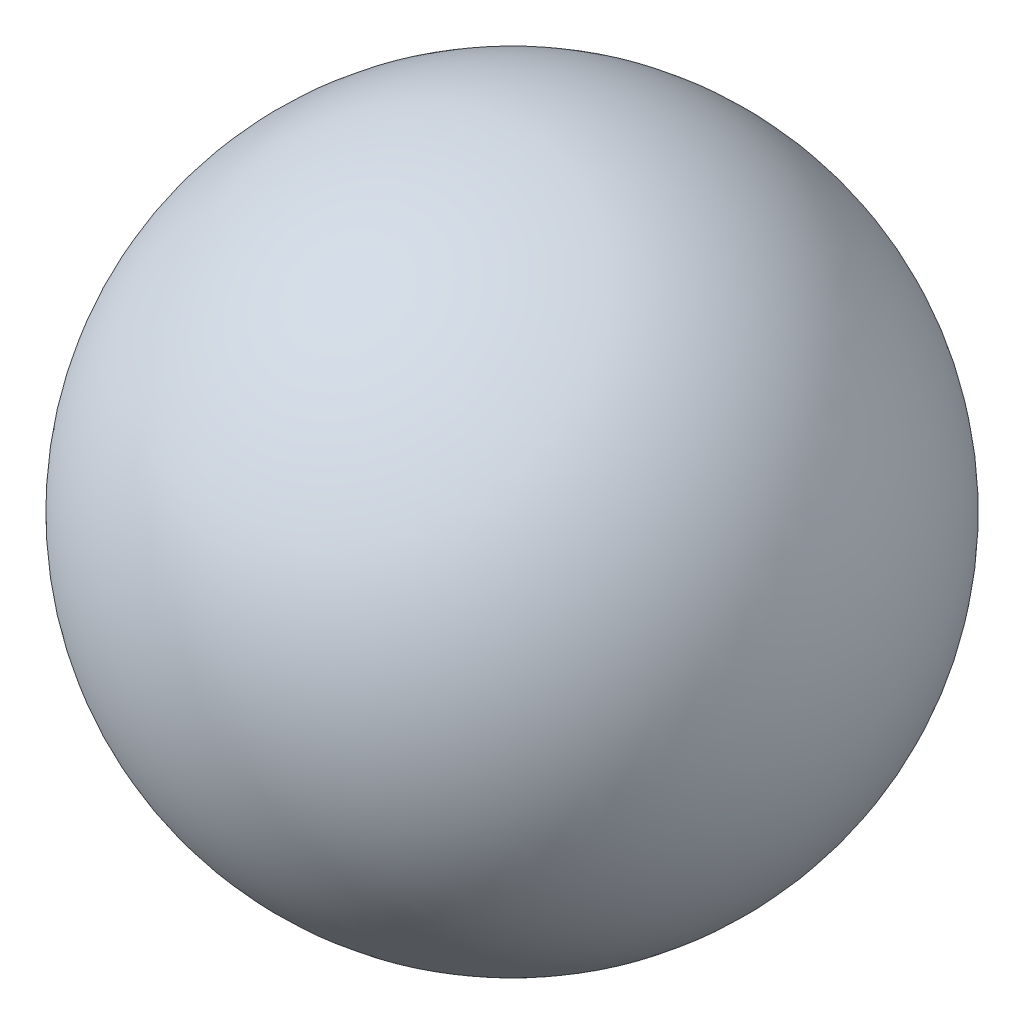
ISO-10303-21;
HEADER;
FILE_DESCRIPTION(('STEP AP214'),'2;1');
FILE_NAME('part.step','',(''),(''),'','','');
FILE_SCHEMA(('AUTOMOTIVE_DESIGN { 1 0 10303 214 1 1 1 1 }'));
ENDSEC;
DATA;
#1=APPLICATION_CONTEXT('core data for automotive mechanical design processes');
#2=APPLICATION_PROTOCOL_DEFINITION('international standard','automotive_design',2000,#1);
#3=PRODUCT_CONTEXT('',#1,'mechanical');
#4=PRODUCT('Part','Part','',(#3));
#5=PRODUCT_RELATED_PRODUCT_CATEGORY('part','',(#4));
#6=PRODUCT_DEFINITION_FORMATION('','',#4);
#7=PRODUCT_DEFINITION_CONTEXT('part definition',#1,'design');
#8=PRODUCT_DEFINITION('design','',#6,#7);
#9=PRODUCT_DEFINITION_SHAPE('','',#8);
#10=(LENGTH_UNIT() NAMED_UNIT(*) SI_UNIT(.MILLI.,.METRE.));
#11=(NAMED_UNIT(*) PLANE_ANGLE_UNIT() SI_UNIT($,.RADIAN.));
#12=(NAMED_UNIT(*) SI_UNIT($,.STERADIAN.) SOLID_ANGLE_UNIT());
#13=UNCERTAINTY_MEASURE_WITH_UNIT(LENGTH_MEASURE(1.E-05),#10,'distance_accuracy_value','');
#14=(GEOMETRIC_REPRESENTATION_CONTEXT(3) GLOBAL_UNCERTAINTY_ASSIGNED_CONTEXT((#13)) GLOBAL_UNIT_ASSIGNED_CONTEXT((#10,
#11,#12)) REPRESENTATION_CONTEXT('',''));
#15=CARTESIAN_POINT('',(0.,0.,0.));
#16=DIRECTION('',(0.,0.,1.));
#17=DIRECTION('',(1.,0.,0.));
#18=AXIS2_PLACEMENT_3D('',#15,#16,#17);
#19=CARTESIAN_POINT('',(0.,0.,0.));
#20=DIRECTION('',(0.,1.,0.));
#21=DIRECTION('',(-1.,0.,0.));
#22=AXIS2_PLACEMENT_3D('',#19,#20,#21);
#23=SPHERICAL_SURFACE('',#22,300.);
#24=CARTESIAN_POINT('',(0.,300.,0.));
#25=VERTEX_POINT('',#24);
#26=VERTEX_LOOP('',#25);
#27=FACE_BOUND('',#26,.T.);
#28=ADVANCED_FACE('F28',(#27),#23,.T.);
#29=CLOSED_SHELL('',(#28));
#30=CARTESIAN_POINT('',(0.,0.,0.));
#31=DIRECTION('',(0.,1.,0.));
#32=DIRECTION('',(1.,0.,0.));
#33=AXIS2_PLACEMENT_3D('',#30,#31,#32);
#34=SPHERICAL_SURFACE('',#33,299.);
#35=CARTESIAN_POINT('',(0.,299.,0.));
#36=VERTEX_POINT('',#35);
#37=VERTEX_LOOP('',#36);
#38=FACE_BOUND('',#37,.T.);
#39=ADVANCED_FACE('F30',(#38),#34,.F.);
#40=CLOSED_SHELL('',(#39));
#41=ORIENTED_CLOSED_SHELL('',*,#40,.T.);
#42=BREP_WITH_VOIDS('B2',#29,(#41));
#43=ADVANCED_BREP_SHAPE_REPRESENTATION('',(#18,#42),#14);
#44=SHAPE_DEFINITION_REPRESENTATION(#9,#43);
ENDSEC;
END-ISO-10303-21;
